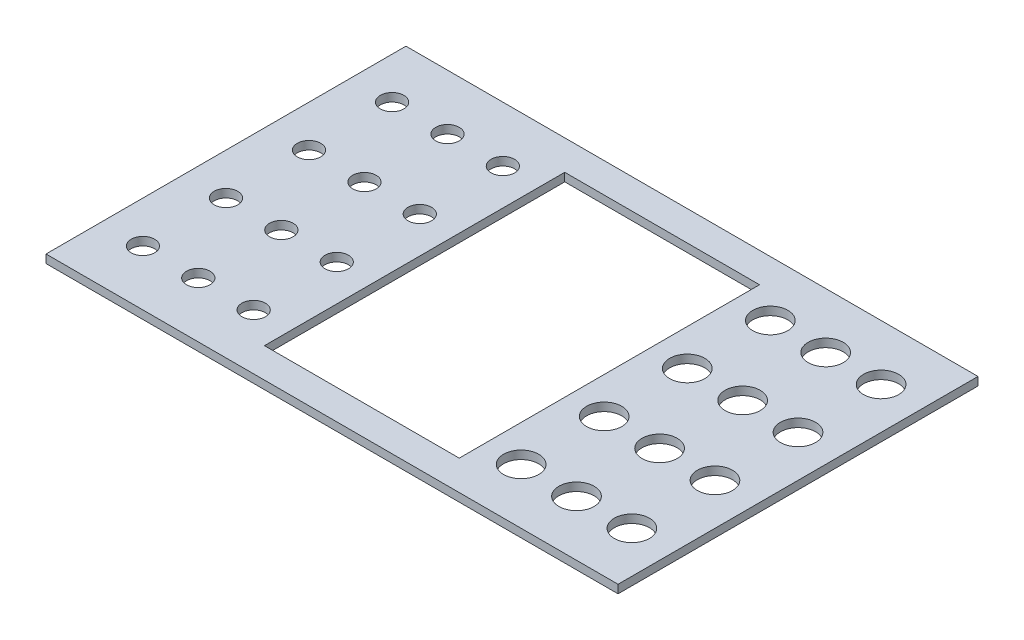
from build123d import *

# Parameters (mm, degrees)
SKETCH3_W           = 413.2
SKETCH3_H           = 260
BOSS_EXTRUDE2_DEPTH = 6
SKETCH4_R           = 8.5
SKETCH4_R_2         = 12.7
CUT_EXTRUDE1_DEPTH  = 10
SKETCH5_W           = 140.7
SKETCH5_H           = 216.9
CUT_EXTRUDE2_DEPTH  = 10


with BuildPart() as part:
    # Sketch3 → Boss-Extrude2 (new body)
    with BuildSketch(Plane(origin=(0, 0, 0), x_dir=(1, 0, 0), z_dir=(0, 1, 0))):
        Rectangle(SKETCH3_W, SKETCH3_H)
    extrude(amount=BOSS_EXTRUDE2_DEPTH)

    # Sketch4 → Cut-Extrude1 (cut)
    with BuildSketch(Plane(origin=(0, 6, 0), x_dir=(1, 0, 0), z_dir=(0, 1, 0))):
        with Locations(Location((-176.6, 90, 0), (0, 0, 270))):
            Circle(SKETCH4_R)
        with Locations(Location((-136.6, 90, 0), (0, 0, 270))):
            Circle(SKETCH4_R)
        with Locations(Location((-96.6, 90, 0), (0, 0, 270))):
            Circle(SKETCH4_R)
        with Locations(Location((-136.6, 30, 0), (0, 0, 270))):
            Circle(SKETCH4_R)
        with Locations(Location((-96.6, 30, 0), (0, 0, 270))):
            Circle(SKETCH4_R)
        with Locations(Location((-136.6, -30, 0), (0, 0, 270))):
            Circle(SKETCH4_R)
        with Locations(Location((-96.6, -30, 0), (0, 0, 270))):
            Circle(SKETCH4_R)
        with Locations(Location((-136.6, -90, 0), (0, 0, 270))):
            Circle(SKETCH4_R)
        with Locations(Location((-96.6, -90, 0), (0, 0, 270))):
            Circle(SKETCH4_R)
        with Locations(Location((-176.6, 30, 0), (0, 0, 270))):
            Circle(SKETCH4_R)
        with Locations(Location((-176.6, -30, 0), (0, 0, 270))):
            Circle(SKETCH4_R)
        with Locations(Location((-176.6, -90, 0), (0, 0, 270))):
            Circle(SKETCH4_R)
        with Locations(Location((176.6, 90, 0), (0, 0, 270))):
            Circle(SKETCH4_R_2)
        with Locations(Location((136.6, 90, 0), (0, 0, 270))):
            Circle(SKETCH4_R_2)
        with Locations(Location((136.6, 30, 0), (0, 0, 270))):
            Circle(SKETCH4_R_2)
        with Locations(Location((136.6, -30, 0), (0, 0, 270))):
            Circle(SKETCH4_R_2)
        with Locations(Location((136.6, -90, 0), (0, 0, 270))):
            Circle(SKETCH4_R_2)
        with Locations(Location((176.6, 30, 0), (0, 0, 270))):
            Circle(SKETCH4_R_2)
        with Locations(Location((176.6, -30, 0), (0, 0, 270))):
            Circle(SKETCH4_R_2)
        with Locations(Location((176.6, -90, 0), (0, 0, 270))):
            Circle(SKETCH4_R_2)
        with Locations(Location((96.6, 90, 0), (0, 0, 270))):
            Circle(SKETCH4_R_2)
        with Locations(Location((96.6, 30, 0), (0, 0, 270))):
            Circle(SKETCH4_R_2)
        with Locations(Location((96.6, -30, 0), (0, 0, 270))):
            Circle(SKETCH4_R_2)
        with Locations(Location((96.6, -90, 0), (0, 0, 270))):
            Circle(SKETCH4_R_2)
    extrude(amount=-CUT_EXTRUDE1_DEPTH, mode=Mode.SUBTRACT)

    # Sketch5 → Cut-Extrude2 (cut)
    with BuildSketch(Plane(origin=(0, 6, 0), x_dir=(1, 0, 0), z_dir=(0, 1, 0))):
        Rectangle(SKETCH5_W, SKETCH5_H)
    extrude(amount=-CUT_EXTRUDE2_DEPTH, mode=Mode.SUBTRACT)


solid = part.part
